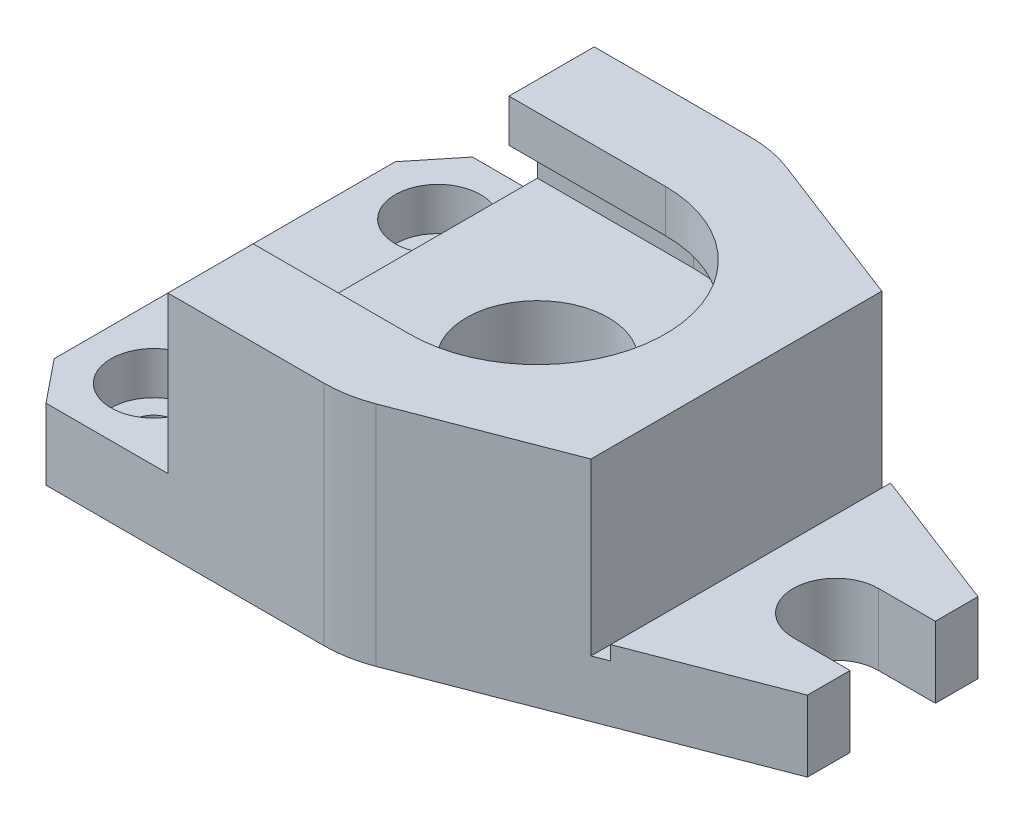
ISO-10303-21;
HEADER;
FILE_DESCRIPTION(('STEP AP214'),'2;1');
FILE_NAME('part.step','',(''),(''),'','','');
FILE_SCHEMA(('AUTOMOTIVE_DESIGN { 1 0 10303 214 1 1 1 1 }'));
ENDSEC;
DATA;
#1=APPLICATION_CONTEXT('core data for automotive mechanical design processes');
#2=APPLICATION_PROTOCOL_DEFINITION('international standard','automotive_design',2000,#1);
#3=PRODUCT_CONTEXT('',#1,'mechanical');
#4=PRODUCT('Part','Part','',(#3));
#5=PRODUCT_RELATED_PRODUCT_CATEGORY('part','',(#4));
#6=PRODUCT_DEFINITION_FORMATION('','',#4);
#7=PRODUCT_DEFINITION_CONTEXT('part definition',#1,'design');
#8=PRODUCT_DEFINITION('design','',#6,#7);
#9=PRODUCT_DEFINITION_SHAPE('','',#8);
#10=(LENGTH_UNIT() NAMED_UNIT(*) SI_UNIT(.MILLI.,.METRE.));
#11=(NAMED_UNIT(*) PLANE_ANGLE_UNIT() SI_UNIT($,.RADIAN.));
#12=(NAMED_UNIT(*) SI_UNIT($,.STERADIAN.) SOLID_ANGLE_UNIT());
#13=UNCERTAINTY_MEASURE_WITH_UNIT(LENGTH_MEASURE(1.E-05),#10,'distance_accuracy_value','');
#14=(GEOMETRIC_REPRESENTATION_CONTEXT(3) GLOBAL_UNCERTAINTY_ASSIGNED_CONTEXT((#13)) GLOBAL_UNIT_ASSIGNED_CONTEXT((#10,
#11,#12)) REPRESENTATION_CONTEXT('',''));
#15=CARTESIAN_POINT('',(0.,0.,0.));
#16=DIRECTION('',(0.,0.,1.));
#17=DIRECTION('',(1.,0.,0.));
#18=AXIS2_PLACEMENT_3D('',#15,#16,#17);
#19=CARTESIAN_POINT('',(-17.,0.,-10.));
#20=DIRECTION('',(0.,1.,0.));
#21=DIRECTION('',(0.,0.,1.));
#22=AXIS2_PLACEMENT_3D('',#19,#20,#21);
#23=CYLINDRICAL_SURFACE('',#22,1.5);
#24=CARTESIAN_POINT('',(-17.,0.,-10.));
#25=DIRECTION('',(0.,1.,0.));
#26=DIRECTION('',(0.,0.,1.));
#27=AXIS2_PLACEMENT_3D('',#24,#25,#26);
#28=CIRCLE('',#27,1.5);
#29=CARTESIAN_POINT('',(-17.,0.,-8.5));
#30=VERTEX_POINT('',#29);
#31=EDGE_CURVE('E270',#30,#30,#28,.T.);
#32=ORIENTED_EDGE('',*,*,#31,.F.);
#33=EDGE_LOOP('',(#32));
#34=FACE_BOUND('',#33,.T.);
#35=CARTESIAN_POINT('',(-17.,2.,-10.));
#36=DIRECTION('',(0.,1.,0.));
#37=DIRECTION('',(0.,0.,1.));
#38=AXIS2_PLACEMENT_3D('',#35,#36,#37);
#39=CIRCLE('',#38,1.5);
#40=CARTESIAN_POINT('',(-17.,2.,-8.5));
#41=VERTEX_POINT('',#40);
#42=EDGE_CURVE('E263',#41,#41,#39,.F.);
#43=ORIENTED_EDGE('',*,*,#42,.F.);
#44=EDGE_LOOP('',(#43));
#45=FACE_BOUND('',#44,.T.);
#46=ADVANCED_FACE('F31',(#34,#45),#23,.F.);
#47=CARTESIAN_POINT('',(0.,5.,-6.39968337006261));
#48=DIRECTION('',(0.,-1.,0.));
#49=DIRECTION('',(0.,0.,-1.));
#50=AXIS2_PLACEMENT_3D('',#47,#48,#49);
#51=PLANE('',#50);
#52=DIRECTION('',(-0.93336269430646,0.,-0.358934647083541));
#53=VECTOR('',#52,1.);
#54=CARTESIAN_POINT('',(25.,5.,-6.));
#55=LINE('',#54,#53);
#56=CARTESIAN_POINT('',(25.,5.,-6.));
#57=VERTEX_POINT('',#56);
#58=CARTESIAN_POINT('',(15.,5.,-9.84560738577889));
#59=VERTEX_POINT('',#58);
#60=EDGE_CURVE('E565',#57,#59,#55,.T.);
#61=ORIENTED_EDGE('',*,*,#60,.T.);
#62=DIRECTION('',(0.,0.,-1.));
#63=VECTOR('',#62,1.);
#64=CARTESIAN_POINT('',(15.,5.,9.84560738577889));
#65=LINE('',#64,#63);
#66=CARTESIAN_POINT('',(15.,5.,9.84560738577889));
#67=VERTEX_POINT('',#66);
#68=EDGE_CURVE('E243',#67,#59,#65,.T.);
#69=ORIENTED_EDGE('',*,*,#68,.F.);
#70=DIRECTION('',(0.93336269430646,0.,-0.358934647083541));
#71=VECTOR('',#70,1.);
#72=CARTESIAN_POINT('',(25.,5.,6.));
#73=LINE('',#72,#71);
#74=CARTESIAN_POINT('',(25.,5.,6.));
#75=VERTEX_POINT('',#74);
#76=EDGE_CURVE('E35',#67,#75,#73,.T.);
#77=ORIENTED_EDGE('',*,*,#76,.T.);
#78=DIRECTION('',(0.,0.,-1.));
#79=VECTOR('',#78,1.);
#80=CARTESIAN_POINT('',(25.,5.,3.));
#81=LINE('',#80,#79);
#82=CARTESIAN_POINT('',(25.,5.,3.));
#83=VERTEX_POINT('',#82);
#84=EDGE_CURVE('E573',#75,#83,#81,.T.);
#85=ORIENTED_EDGE('',*,*,#84,.T.);
#86=DIRECTION('',(-1.,0.,0.));
#87=VECTOR('',#86,1.);
#88=CARTESIAN_POINT('',(21.,5.,3.));
#89=LINE('',#88,#87);
#90=CARTESIAN_POINT('',(21.,5.,3.));
#91=VERTEX_POINT('',#90);
#92=EDGE_CURVE('E575',#83,#91,#89,.T.);
#93=ORIENTED_EDGE('',*,*,#92,.T.);
#94=CARTESIAN_POINT('',(21.,5.,0.));
#95=DIRECTION('',(0.,-1.,0.));
#96=DIRECTION('',(0.,0.,1.));
#97=AXIS2_PLACEMENT_3D('',#94,#95,#96);
#98=CIRCLE('',#97,3.);
#99=CARTESIAN_POINT('',(21.,5.,-3.));
#100=VERTEX_POINT('',#99);
#101=EDGE_CURVE('E577',#91,#100,#98,.T.);
#102=ORIENTED_EDGE('',*,*,#101,.T.);
#103=DIRECTION('',(1.,0.,0.));
#104=VECTOR('',#103,1.);
#105=CARTESIAN_POINT('',(21.,5.,-3.));
#106=LINE('',#105,#104);
#107=CARTESIAN_POINT('',(25.,5.,-3.));
#108=VERTEX_POINT('',#107);
#109=EDGE_CURVE('E579',#100,#108,#106,.T.);
#110=ORIENTED_EDGE('',*,*,#109,.T.);
#111=DIRECTION('',(0.,0.,-1.));
#112=VECTOR('',#111,1.);
#113=CARTESIAN_POINT('',(25.,5.,-3.));
#114=LINE('',#113,#112);
#115=EDGE_CURVE('E581',#108,#57,#114,.T.);
#116=ORIENTED_EDGE('',*,*,#115,.T.);
#117=EDGE_LOOP('',(#61,#69,#77,#85,#93,#102,#110,#116));
#118=FACE_BOUND('',#117,.T.);
#119=ADVANCED_FACE('F367',(#118),#51,.F.);
#120=CARTESIAN_POINT('',(-17.,5.,10.));
#121=DIRECTION('',(0.,1.,0.));
#122=DIRECTION('',(0.,0.,-1.));
#123=AXIS2_PLACEMENT_3D('',#120,#121,#122);
#124=CIRCLE('',#123,3.);
#125=CARTESIAN_POINT('',(-17.,5.,7.));
#126=VERTEX_POINT('',#125);
#127=EDGE_CURVE('E252',#126,#126,#124,.T.);
#128=ORIENTED_EDGE('',*,*,#127,.F.);
#129=EDGE_LOOP('',(#128));
#130=FACE_BOUND('',#129,.T.);
#131=CARTESIAN_POINT('',(-17.,5.,-10.));
#132=DIRECTION('',(0.,1.,0.));
#133=DIRECTION('',(0.,0.,1.));
#134=AXIS2_PLACEMENT_3D('',#131,#132,#133);
#135=CIRCLE('',#134,3.);
#136=CARTESIAN_POINT('',(-17.,5.,-7.));
#137=VERTEX_POINT('',#136);
#138=EDGE_CURVE('E264',#137,#137,#135,.T.);
#139=ORIENTED_EDGE('',*,*,#138,.F.);
#140=EDGE_LOOP('',(#139));
#141=FACE_BOUND('',#140,.T.);
#142=DIRECTION('',(0.,0.,1.));
#143=VECTOR('',#142,1.);
#144=CARTESIAN_POINT('',(-11.,5.,11.));
#145=LINE('',#144,#143);
#146=CARTESIAN_POINT('',(-11.,5.,-15.));
#147=VERTEX_POINT('',#146);
#148=CARTESIAN_POINT('',(-11.,5.,15.));
#149=VERTEX_POINT('',#148);
#150=EDGE_CURVE('E586',#147,#149,#145,.T.);
#151=ORIENTED_EDGE('',*,*,#150,.F.);
#152=DIRECTION('',(-1.,0.,0.));
#153=VECTOR('',#152,1.);
#154=CARTESIAN_POINT('',(-19.5748211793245,5.,-15.));
#155=LINE('',#154,#153);
#156=CARTESIAN_POINT('',(-19.5748211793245,5.,-15.));
#157=VERTEX_POINT('',#156);
#158=EDGE_CURVE('E531',#147,#157,#155,.T.);
#159=ORIENTED_EDGE('',*,*,#158,.T.);
#160=DIRECTION('',(-0.628666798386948,0.,0.777674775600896));
#161=VECTOR('',#160,1.);
#162=CARTESIAN_POINT('',(-22.,5.,-12.));
#163=LINE('',#162,#161);
#164=CARTESIAN_POINT('',(-22.,5.,-12.));
#165=VERTEX_POINT('',#164);
#166=EDGE_CURVE('E526',#157,#165,#163,.T.);
#167=ORIENTED_EDGE('',*,*,#166,.T.);
#168=DIRECTION('',(0.,0.,1.));
#169=VECTOR('',#168,1.);
#170=CARTESIAN_POINT('',(-22.,5.,12.));
#171=LINE('',#170,#169);
#172=CARTESIAN_POINT('',(-22.,5.,12.));
#173=VERTEX_POINT('',#172);
#174=EDGE_CURVE('E599',#165,#173,#171,.T.);
#175=ORIENTED_EDGE('',*,*,#174,.T.);
#176=DIRECTION('',(0.628666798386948,0.,0.777674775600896));
#177=VECTOR('',#176,1.);
#178=CARTESIAN_POINT('',(-22.,5.,12.));
#179=LINE('',#178,#177);
#180=CARTESIAN_POINT('',(-19.5748211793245,5.,15.));
#181=VERTEX_POINT('',#180);
#182=EDGE_CURVE('E496',#173,#181,#179,.T.);
#183=ORIENTED_EDGE('',*,*,#182,.T.);
#184=DIRECTION('',(1.,0.,0.));
#185=VECTOR('',#184,1.);
#186=CARTESIAN_POINT('',(-19.5748211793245,5.,15.));
#187=LINE('',#186,#185);
#188=EDGE_CURVE('E562',#181,#149,#187,.T.);
#189=ORIENTED_EDGE('',*,*,#188,.T.);
#190=EDGE_LOOP('',(#151,#159,#167,#175,#183,#189));
#191=FACE_BOUND('',#190,.T.);
#192=ADVANCED_FACE('F373',(#130,#141,#191),#51,.F.);
#193=CARTESIAN_POINT('',(-22.,5.,-12.));
#194=DIRECTION('',(0.777674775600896,0.,0.628666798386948));
#195=DIRECTION('',(0.628666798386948,0.,-0.777674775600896));
#196=AXIS2_PLACEMENT_3D('',#193,#194,#195);
#197=PLANE('',#196);
#198=DIRECTION('',(-0.628666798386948,0.,0.777674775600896));
#199=VECTOR('',#198,1.);
#200=CARTESIAN_POINT('',(-22.,0.,-12.));
#201=LINE('',#200,#199);
#202=CARTESIAN_POINT('',(-19.5748211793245,0.,-15.));
#203=VERTEX_POINT('',#202);
#204=CARTESIAN_POINT('',(-22.,0.,-12.));
#205=VERTEX_POINT('',#204);
#206=EDGE_CURVE('E492',#203,#205,#201,.T.);
#207=ORIENTED_EDGE('',*,*,#206,.T.);
#208=DIRECTION('',(0.,-1.,0.));
#209=VECTOR('',#208,1.);
#210=CARTESIAN_POINT('',(-22.,5.,-12.));
#211=LINE('',#210,#209);
#212=EDGE_CURVE('E11',#165,#205,#211,.T.);
#213=ORIENTED_EDGE('',*,*,#212,.F.);
#214=ORIENTED_EDGE('',*,*,#166,.F.);
#215=DIRECTION('',(0.,-1.,0.));
#216=VECTOR('',#215,1.);
#217=CARTESIAN_POINT('',(-19.5748211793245,5.,-15.));
#218=LINE('',#217,#216);
#219=EDGE_CURVE('E527',#157,#203,#218,.T.);
#220=ORIENTED_EDGE('',*,*,#219,.T.);
#221=EDGE_LOOP('',(#207,#213,#214,#220));
#222=FACE_BOUND('',#221,.T.);
#223=ADVANCED_FACE('F33',(#222),#197,.F.);
#224=CARTESIAN_POINT('',(-22.,5.,12.));
#225=DIRECTION('',(1.,0.,0.));
#226=DIRECTION('',(0.,0.,-1.));
#227=AXIS2_PLACEMENT_3D('',#224,#225,#226);
#228=PLANE('',#227);
#229=DIRECTION('',(0.,0.,1.));
#230=VECTOR('',#229,1.);
#231=CARTESIAN_POINT('',(-22.,0.,12.));
#232=LINE('',#231,#230);
#233=CARTESIAN_POINT('',(-22.,0.,12.));
#234=VERTEX_POINT('',#233);
#235=EDGE_CURVE('E483',#205,#234,#232,.T.);
#236=ORIENTED_EDGE('',*,*,#235,.T.);
#237=DIRECTION('',(0.,-1.,0.));
#238=VECTOR('',#237,1.);
#239=CARTESIAN_POINT('',(-22.,5.,12.));
#240=LINE('',#239,#238);
#241=EDGE_CURVE('E41',#173,#234,#240,.T.);
#242=ORIENTED_EDGE('',*,*,#241,.F.);
#243=ORIENTED_EDGE('',*,*,#174,.F.);
#244=ORIENTED_EDGE('',*,*,#212,.T.);
#245=EDGE_LOOP('',(#236,#242,#243,#244));
#246=FACE_BOUND('',#245,.T.);
#247=ADVANCED_FACE('F474',(#246),#228,.F.);
#248=CARTESIAN_POINT('',(-22.,5.,12.));
#249=DIRECTION('',(0.777674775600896,0.,-0.628666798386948));
#250=DIRECTION('',(-0.628666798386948,0.,-0.777674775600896));
#251=AXIS2_PLACEMENT_3D('',#248,#249,#250);
#252=PLANE('',#251);
#253=DIRECTION('',(0.628666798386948,0.,0.777674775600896));
#254=VECTOR('',#253,1.);
#255=CARTESIAN_POINT('',(-22.,0.,12.));
#256=LINE('',#255,#254);
#257=CARTESIAN_POINT('',(-19.5748211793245,0.,15.));
#258=VERTEX_POINT('',#257);
#259=EDGE_CURVE('E491',#234,#258,#256,.T.);
#260=ORIENTED_EDGE('',*,*,#259,.T.);
#261=DIRECTION('',(0.,-1.,0.));
#262=VECTOR('',#261,1.);
#263=CARTESIAN_POINT('',(-19.5748211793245,5.,15.));
#264=LINE('',#263,#262);
#265=EDGE_CURVE('E497',#181,#258,#264,.T.);
#266=ORIENTED_EDGE('',*,*,#265,.F.);
#267=ORIENTED_EDGE('',*,*,#182,.F.);
#268=ORIENTED_EDGE('',*,*,#241,.T.);
#269=EDGE_LOOP('',(#260,#266,#267,#268));
#270=FACE_BOUND('',#269,.T.);
#271=ADVANCED_FACE('F471',(#270),#252,.F.);
#272=CARTESIAN_POINT('',(-19.5748211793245,5.,15.));
#273=DIRECTION('',(0.,0.,-1.));
#274=DIRECTION('',(-1.,0.,0.));
#275=AXIS2_PLACEMENT_3D('',#272,#273,#274);
#276=PLANE('',#275);
#277=DIRECTION('',(1.,0.,0.));
#278=VECTOR('',#277,1.);
#279=CARTESIAN_POINT('',(-19.5748211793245,0.,15.));
#280=LINE('',#279,#278);
#281=CARTESIAN_POINT('',(0.,0.,15.));
#282=VERTEX_POINT('',#281);
#283=EDGE_CURVE('E501',#258,#282,#280,.T.);
#284=ORIENTED_EDGE('',*,*,#283,.T.);
#285=DIRECTION('',(0.,-1.,0.));
#286=VECTOR('',#285,1.);
#287=CARTESIAN_POINT('',(0.,5.,15.));
#288=LINE('',#287,#286);
#289=CARTESIAN_POINT('',(0.,16.,15.));
#290=VERTEX_POINT('',#289);
#291=EDGE_CURVE('E558',#290,#282,#288,.T.);
#292=ORIENTED_EDGE('',*,*,#291,.F.);
#293=DIRECTION('',(1.,0.,0.));
#294=VECTOR('',#293,1.);
#295=CARTESIAN_POINT('',(-11.,16.,15.));
#296=LINE('',#295,#294);
#297=CARTESIAN_POINT('',(-11.,16.,15.));
#298=VERTEX_POINT('',#297);
#299=EDGE_CURVE('E289',#298,#290,#296,.T.);
#300=ORIENTED_EDGE('',*,*,#299,.F.);
#301=DIRECTION('',(0.,-1.,0.));
#302=VECTOR('',#301,1.);
#303=CARTESIAN_POINT('',(-11.,10.,15.));
#304=LINE('',#303,#302);
#305=EDGE_CURVE('E591',#298,#149,#304,.T.);
#306=ORIENTED_EDGE('',*,*,#305,.T.);
#307=ORIENTED_EDGE('',*,*,#188,.F.);
#308=ORIENTED_EDGE('',*,*,#265,.T.);
#309=EDGE_LOOP('',(#284,#292,#300,#306,#307,#308));
#310=FACE_BOUND('',#309,.T.);
#311=ADVANCED_FACE('F467',(#310),#276,.F.);
#312=CARTESIAN_POINT('',(0.,5.,6.39968337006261));
#313=DIRECTION('',(0.,-1.,0.));
#314=DIRECTION('',(0.,0.,-1.));
#315=AXIS2_PLACEMENT_3D('',#312,#313,#314);
#316=CYLINDRICAL_SURFACE('',#315,8.60031662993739);
#317=CARTESIAN_POINT('',(0.,0.,6.39968337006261));
#318=DIRECTION('',(0.,1.,0.));
#319=DIRECTION('',(0.,0.,1.));
#320=AXIS2_PLACEMENT_3D('',#317,#318,#319);
#321=CIRCLE('',#320,8.60031662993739);
#322=CARTESIAN_POINT('',(3.08695161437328,0.,14.4268980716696));
#323=VERTEX_POINT('',#322);
#324=EDGE_CURVE('E503',#282,#323,#321,.T.);
#325=ORIENTED_EDGE('',*,*,#324,.T.);
#326=DIRECTION('',(0.,-1.,0.));
#327=VECTOR('',#326,1.);
#328=CARTESIAN_POINT('',(3.08695161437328,5.,14.4268980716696));
#329=LINE('',#328,#327);
#330=CARTESIAN_POINT('',(3.08695161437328,16.,14.4268980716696));
#331=VERTEX_POINT('',#330);
#332=EDGE_CURVE('E555',#331,#323,#329,.T.);
#333=ORIENTED_EDGE('',*,*,#332,.F.);
#334=CARTESIAN_POINT('',(0.,16.,6.39968337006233));
#335=DIRECTION('',(0.,1.,0.));
#336=DIRECTION('',(0.,0.,1.));
#337=AXIS2_PLACEMENT_3D('',#334,#335,#336);
#338=CIRCLE('',#337,8.60031662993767);
#339=EDGE_CURVE('E292',#290,#331,#338,.T.);
#340=ORIENTED_EDGE('',*,*,#339,.F.);
#341=ORIENTED_EDGE('',*,*,#291,.T.);
#342=EDGE_LOOP('',(#325,#333,#340,#341));
#343=FACE_BOUND('',#342,.T.);
#344=ADVANCED_FACE('F463',(#343),#316,.T.);
#345=CARTESIAN_POINT('',(25.,5.,6.));
#346=DIRECTION('',(-0.358934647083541,0.,-0.93336269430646));
#347=DIRECTION('',(-0.93336269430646,0.,0.358934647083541));
#348=AXIS2_PLACEMENT_3D('',#345,#346,#347);
#349=PLANE('',#348);
#350=ORIENTED_EDGE('',*,*,#76,.F.);
#351=DIRECTION('',(0.,1.,0.));
#352=VECTOR('',#351,1.);
#353=CARTESIAN_POINT('',(15.,4.,9.84560738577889));
#354=LINE('',#353,#352);
#355=CARTESIAN_POINT('',(15.,4.,9.84560738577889));
#356=VERTEX_POINT('',#355);
#357=EDGE_CURVE('E248',#356,#67,#354,.T.);
#358=ORIENTED_EDGE('',*,*,#357,.F.);
#359=DIRECTION('',(0.93336269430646,0.,-0.358934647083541));
#360=VECTOR('',#359,1.);
#361=CARTESIAN_POINT('',(14.,4.,10.2301681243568));
#362=LINE('',#361,#360);
#363=CARTESIAN_POINT('',(14.,4.,10.2301681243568));
#364=VERTEX_POINT('',#363);
#365=EDGE_CURVE('E237',#364,#356,#362,.T.);
#366=ORIENTED_EDGE('',*,*,#365,.F.);
#367=DIRECTION('',(0.,-1.,0.));
#368=VECTOR('',#367,1.);
#369=CARTESIAN_POINT('',(14.,10.,10.2301681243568));
#370=LINE('',#369,#368);
#371=CARTESIAN_POINT('',(14.,16.,10.2301681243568));
#372=VERTEX_POINT('',#371);
#373=EDGE_CURVE('E229',#372,#364,#370,.T.);
#374=ORIENTED_EDGE('',*,*,#373,.F.);
#375=DIRECTION('',(0.93336269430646,0.,-0.358934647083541));
#376=VECTOR('',#375,1.);
#377=CARTESIAN_POINT('',(14.,16.,10.2301681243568));
#378=LINE('',#377,#376);
#379=EDGE_CURVE('E295',#331,#372,#378,.T.);
#380=ORIENTED_EDGE('',*,*,#379,.F.);
#381=ORIENTED_EDGE('',*,*,#332,.T.);
#382=DIRECTION('',(0.93336269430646,0.,-0.358934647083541));
#383=VECTOR('',#382,1.);
#384=CARTESIAN_POINT('',(25.,0.,6.));
#385=LINE('',#384,#383);
#386=CARTESIAN_POINT('',(25.,0.,6.));
#387=VERTEX_POINT('',#386);
#388=EDGE_CURVE('E508',#323,#387,#385,.T.);
#389=ORIENTED_EDGE('',*,*,#388,.T.);
#390=DIRECTION('',(0.,-1.,0.));
#391=VECTOR('',#390,1.);
#392=CARTESIAN_POINT('',(25.,5.,6.));
#393=LINE('',#392,#391);
#394=EDGE_CURVE('E552',#75,#387,#393,.T.);
#395=ORIENTED_EDGE('',*,*,#394,.F.);
#396=EDGE_LOOP('',(#350,#358,#366,#374,#380,#381,#389,#395));
#397=FACE_BOUND('',#396,.T.);
#398=ADVANCED_FACE('F459',(#397),#349,.F.);
#399=CARTESIAN_POINT('',(25.,5.,3.));
#400=DIRECTION('',(-1.,0.,0.));
#401=DIRECTION('',(0.,0.,1.));
#402=AXIS2_PLACEMENT_3D('',#399,#400,#401);
#403=PLANE('',#402);
#404=DIRECTION('',(0.,0.,-1.));
#405=VECTOR('',#404,1.);
#406=CARTESIAN_POINT('',(25.,0.,3.));
#407=LINE('',#406,#405);
#408=CARTESIAN_POINT('',(25.,0.,3.));
#409=VERTEX_POINT('',#408);
#410=EDGE_CURVE('E510',#387,#409,#407,.T.);
#411=ORIENTED_EDGE('',*,*,#410,.T.);
#412=DIRECTION('',(0.,-1.,0.));
#413=VECTOR('',#412,1.);
#414=CARTESIAN_POINT('',(25.,5.,3.));
#415=LINE('',#414,#413);
#416=EDGE_CURVE('E549',#83,#409,#415,.T.);
#417=ORIENTED_EDGE('',*,*,#416,.F.);
#418=ORIENTED_EDGE('',*,*,#84,.F.);
#419=ORIENTED_EDGE('',*,*,#394,.T.);
#420=EDGE_LOOP('',(#411,#417,#418,#419));
#421=FACE_BOUND('',#420,.T.);
#422=ADVANCED_FACE('F455',(#421),#403,.F.);
#423=CARTESIAN_POINT('',(21.,5.,3.));
#424=DIRECTION('',(0.,0.,1.));
#425=DIRECTION('',(1.,0.,0.));
#426=AXIS2_PLACEMENT_3D('',#423,#424,#425);
#427=PLANE('',#426);
#428=DIRECTION('',(-1.,0.,0.));
#429=VECTOR('',#428,1.);
#430=CARTESIAN_POINT('',(21.,0.,3.));
#431=LINE('',#430,#429);
#432=CARTESIAN_POINT('',(21.,0.,3.));
#433=VERTEX_POINT('',#432);
#434=EDGE_CURVE('E512',#409,#433,#431,.T.);
#435=ORIENTED_EDGE('',*,*,#434,.T.);
#436=DIRECTION('',(0.,-1.,0.));
#437=VECTOR('',#436,1.);
#438=CARTESIAN_POINT('',(21.,5.,3.));
#439=LINE('',#438,#437);
#440=EDGE_CURVE('E546',#91,#433,#439,.T.);
#441=ORIENTED_EDGE('',*,*,#440,.F.);
#442=ORIENTED_EDGE('',*,*,#92,.F.);
#443=ORIENTED_EDGE('',*,*,#416,.T.);
#444=EDGE_LOOP('',(#435,#441,#442,#443));
#445=FACE_BOUND('',#444,.T.);
#446=ADVANCED_FACE('F451',(#445),#427,.F.);
#447=CARTESIAN_POINT('',(21.,5.,0.));
#448=DIRECTION('',(0.,-1.,0.));
#449=DIRECTION('',(0.,0.,-1.));
#450=AXIS2_PLACEMENT_3D('',#447,#448,#449);
#451=CYLINDRICAL_SURFACE('',#450,3.);
#452=CARTESIAN_POINT('',(21.,0.,0.));
#453=DIRECTION('',(0.,-1.,0.));
#454=DIRECTION('',(0.,0.,1.));
#455=AXIS2_PLACEMENT_3D('',#452,#453,#454);
#456=CIRCLE('',#455,3.);
#457=CARTESIAN_POINT('',(21.,0.,-3.));
#458=VERTEX_POINT('',#457);
#459=EDGE_CURVE('E514',#433,#458,#456,.T.);
#460=ORIENTED_EDGE('',*,*,#459,.T.);
#461=DIRECTION('',(0.,-1.,0.));
#462=VECTOR('',#461,1.);
#463=CARTESIAN_POINT('',(21.,5.,-3.));
#464=LINE('',#463,#462);
#465=EDGE_CURVE('E543',#100,#458,#464,.T.);
#466=ORIENTED_EDGE('',*,*,#465,.F.);
#467=ORIENTED_EDGE('',*,*,#101,.F.);
#468=ORIENTED_EDGE('',*,*,#440,.T.);
#469=EDGE_LOOP('',(#460,#466,#467,#468));
#470=FACE_BOUND('',#469,.T.);
#471=ADVANCED_FACE('F447',(#470),#451,.F.);
#472=CARTESIAN_POINT('',(21.,5.,-3.));
#473=DIRECTION('',(0.,0.,-1.));
#474=DIRECTION('',(-1.,0.,0.));
#475=AXIS2_PLACEMENT_3D('',#472,#473,#474);
#476=PLANE('',#475);
#477=DIRECTION('',(1.,0.,0.));
#478=VECTOR('',#477,1.);
#479=CARTESIAN_POINT('',(21.,0.,-3.));
#480=LINE('',#479,#478);
#481=CARTESIAN_POINT('',(25.,0.,-3.));
#482=VERTEX_POINT('',#481);
#483=EDGE_CURVE('E516',#458,#482,#480,.T.);
#484=ORIENTED_EDGE('',*,*,#483,.T.);
#485=DIRECTION('',(0.,-1.,0.));
#486=VECTOR('',#485,1.);
#487=CARTESIAN_POINT('',(25.,5.,-3.));
#488=LINE('',#487,#486);
#489=EDGE_CURVE('E540',#108,#482,#488,.T.);
#490=ORIENTED_EDGE('',*,*,#489,.F.);
#491=ORIENTED_EDGE('',*,*,#109,.F.);
#492=ORIENTED_EDGE('',*,*,#465,.T.);
#493=EDGE_LOOP('',(#484,#490,#491,#492));
#494=FACE_BOUND('',#493,.T.);
#495=ADVANCED_FACE('F443',(#494),#476,.F.);
#496=CARTESIAN_POINT('',(25.,5.,-3.));
#497=DIRECTION('',(-1.,0.,0.));
#498=DIRECTION('',(0.,0.,1.));
#499=AXIS2_PLACEMENT_3D('',#496,#497,#498);
#500=PLANE('',#499);
#501=DIRECTION('',(0.,0.,-1.));
#502=VECTOR('',#501,1.);
#503=CARTESIAN_POINT('',(25.,0.,-3.));
#504=LINE('',#503,#502);
#505=CARTESIAN_POINT('',(25.,0.,-6.));
#506=VERTEX_POINT('',#505);
#507=EDGE_CURVE('E518',#482,#506,#504,.T.);
#508=ORIENTED_EDGE('',*,*,#507,.T.);
#509=DIRECTION('',(0.,-1.,0.));
#510=VECTOR('',#509,1.);
#511=CARTESIAN_POINT('',(25.,5.,-6.));
#512=LINE('',#511,#510);
#513=EDGE_CURVE('E537',#57,#506,#512,.T.);
#514=ORIENTED_EDGE('',*,*,#513,.F.);
#515=ORIENTED_EDGE('',*,*,#115,.F.);
#516=ORIENTED_EDGE('',*,*,#489,.T.);
#517=EDGE_LOOP('',(#508,#514,#515,#516));
#518=FACE_BOUND('',#517,.T.);
#519=ADVANCED_FACE('F440',(#518),#500,.F.);
#520=CARTESIAN_POINT('',(25.,5.,-6.));
#521=DIRECTION('',(-0.358934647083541,0.,0.93336269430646));
#522=DIRECTION('',(0.93336269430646,0.,0.358934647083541));
#523=AXIS2_PLACEMENT_3D('',#520,#521,#522);
#524=PLANE('',#523);
#525=DIRECTION('',(-0.933362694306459,0.,-0.358934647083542));
#526=VECTOR('',#525,1.);
#527=CARTESIAN_POINT('',(15.,4.,-9.84560738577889));
#528=LINE('',#527,#526);
#529=CARTESIAN_POINT('',(15.,4.,-9.84560738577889));
#530=VERTEX_POINT('',#529);
#531=CARTESIAN_POINT('',(14.,4.,-10.2301681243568));
#532=VERTEX_POINT('',#531);
#533=EDGE_CURVE('E223',#530,#532,#528,.T.);
#534=ORIENTED_EDGE('',*,*,#533,.F.);
#535=DIRECTION('',(0.,1.,0.));
#536=VECTOR('',#535,1.);
#537=CARTESIAN_POINT('',(15.,4.,-9.84560738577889));
#538=LINE('',#537,#536);
#539=EDGE_CURVE('E250',#530,#59,#538,.T.);
#540=ORIENTED_EDGE('',*,*,#539,.T.);
#541=ORIENTED_EDGE('',*,*,#60,.F.);
#542=ORIENTED_EDGE('',*,*,#513,.T.);
#543=DIRECTION('',(-0.93336269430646,0.,-0.358934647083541));
#544=VECTOR('',#543,1.);
#545=CARTESIAN_POINT('',(25.,0.,-6.));
#546=LINE('',#545,#544);
#547=CARTESIAN_POINT('',(3.08695161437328,0.,-14.4268980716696));
#548=VERTEX_POINT('',#547);
#549=EDGE_CURVE('E520',#506,#548,#546,.T.);
#550=ORIENTED_EDGE('',*,*,#549,.T.);
#551=DIRECTION('',(0.,-1.,0.));
#552=VECTOR('',#551,1.);
#553=CARTESIAN_POINT('',(3.08695161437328,5.,-14.4268980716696));
#554=LINE('',#553,#552);
#555=CARTESIAN_POINT('',(3.08695161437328,16.,-14.4268980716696));
#556=VERTEX_POINT('',#555);
#557=EDGE_CURVE('E534',#556,#548,#554,.T.);
#558=ORIENTED_EDGE('',*,*,#557,.F.);
#559=DIRECTION('',(-0.93336269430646,0.,-0.358934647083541));
#560=VECTOR('',#559,1.);
#561=CARTESIAN_POINT('',(3.08695161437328,16.,-14.4268980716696));
#562=LINE('',#561,#560);
#563=CARTESIAN_POINT('',(14.,16.,-10.2301681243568));
#564=VERTEX_POINT('',#563);
#565=EDGE_CURVE('E225',#564,#556,#562,.T.);
#566=ORIENTED_EDGE('',*,*,#565,.F.);
#567=DIRECTION('',(0.,-1.,0.));
#568=VECTOR('',#567,1.);
#569=CARTESIAN_POINT('',(14.,10.,-10.2301681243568));
#570=LINE('',#569,#568);
#571=EDGE_CURVE('E218',#564,#532,#570,.T.);
#572=ORIENTED_EDGE('',*,*,#571,.T.);
#573=EDGE_LOOP('',(#534,#540,#541,#542,#550,#558,#566,#572));
#574=FACE_BOUND('',#573,.T.);
#575=ADVANCED_FACE('F220',(#574),#524,.F.);
#576=CARTESIAN_POINT('',(0.,5.,-6.39968337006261));
#577=DIRECTION('',(0.,-1.,0.));
#578=DIRECTION('',(0.,0.,-1.));
#579=AXIS2_PLACEMENT_3D('',#576,#577,#578);
#580=CYLINDRICAL_SURFACE('',#579,8.60031662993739);
#581=CARTESIAN_POINT('',(0.,0.,-6.39968337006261));
#582=DIRECTION('',(0.,1.,0.));
#583=DIRECTION('',(0.,0.,-1.));
#584=AXIS2_PLACEMENT_3D('',#581,#582,#583);
#585=CIRCLE('',#584,8.60031662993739);
#586=CARTESIAN_POINT('',(0.,0.,-15.));
#587=VERTEX_POINT('',#586);
#588=EDGE_CURVE('E522',#548,#587,#585,.T.);
#589=ORIENTED_EDGE('',*,*,#588,.T.);
#590=DIRECTION('',(0.,-1.,0.));
#591=VECTOR('',#590,1.);
#592=CARTESIAN_POINT('',(0.,5.,-15.));
#593=LINE('',#592,#591);
#594=CARTESIAN_POINT('',(0.,16.,-15.));
#595=VERTEX_POINT('',#594);
#596=EDGE_CURVE('E530',#595,#587,#593,.T.);
#597=ORIENTED_EDGE('',*,*,#596,.F.);
#598=CARTESIAN_POINT('',(0.,16.,-6.39968337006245));
#599=DIRECTION('',(0.,1.,0.));
#600=DIRECTION('',(0.,0.,-1.));
#601=AXIS2_PLACEMENT_3D('',#598,#599,#600);
#602=CIRCLE('',#601,8.60031662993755);
#603=EDGE_CURVE('E301',#556,#595,#602,.T.);
#604=ORIENTED_EDGE('',*,*,#603,.F.);
#605=ORIENTED_EDGE('',*,*,#557,.T.);
#606=EDGE_LOOP('',(#589,#597,#604,#605));
#607=FACE_BOUND('',#606,.T.);
#608=ADVANCED_FACE('F433',(#607),#580,.T.);
#609=CARTESIAN_POINT('',(-19.5748211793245,5.,-15.));
#610=DIRECTION('',(0.,0.,1.));
#611=DIRECTION('',(1.,0.,0.));
#612=AXIS2_PLACEMENT_3D('',#609,#610,#611);
#613=PLANE('',#612);
#614=DIRECTION('',(-1.,0.,0.));
#615=VECTOR('',#614,1.);
#616=CARTESIAN_POINT('',(-19.5748211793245,0.,-15.));
#617=LINE('',#616,#615);
#618=EDGE_CURVE('E524',#587,#203,#617,.T.);
#619=ORIENTED_EDGE('',*,*,#618,.T.);
#620=ORIENTED_EDGE('',*,*,#219,.F.);
#621=ORIENTED_EDGE('',*,*,#158,.F.);
#622=DIRECTION('',(0.,-1.,0.));
#623=VECTOR('',#622,1.);
#624=CARTESIAN_POINT('',(-11.,10.,-15.));
#625=LINE('',#624,#623);
#626=CARTESIAN_POINT('',(-11.,16.,-15.));
#627=VERTEX_POINT('',#626);
#628=EDGE_CURVE('E605',#627,#147,#625,.T.);
#629=ORIENTED_EDGE('',*,*,#628,.F.);
#630=DIRECTION('',(-1.,0.,0.));
#631=VECTOR('',#630,1.);
#632=CARTESIAN_POINT('',(-11.,16.,-15.));
#633=LINE('',#632,#631);
#634=EDGE_CURVE('E304',#595,#627,#633,.T.);
#635=ORIENTED_EDGE('',*,*,#634,.F.);
#636=ORIENTED_EDGE('',*,*,#596,.T.);
#637=EDGE_LOOP('',(#619,#620,#621,#629,#635,#636));
#638=FACE_BOUND('',#637,.T.);
#639=ADVANCED_FACE('F429',(#638),#613,.F.);
#640=CARTESIAN_POINT('',(0.,0.,-6.39968337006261));
#641=DIRECTION('',(0.,-1.,0.));
#642=DIRECTION('',(0.,0.,-1.));
#643=AXIS2_PLACEMENT_3D('',#640,#641,#642);
#644=PLANE('',#643);
#645=CARTESIAN_POINT('',(-17.,0.,10.));
#646=DIRECTION('',(0.,1.,0.));
#647=DIRECTION('',(0.,0.,-1.));
#648=AXIS2_PLACEMENT_3D('',#645,#646,#647);
#649=CIRCLE('',#648,1.49999999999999);
#650=CARTESIAN_POINT('',(-17.,0.,8.5));
#651=VERTEX_POINT('',#650);
#652=EDGE_CURVE('E267',#651,#651,#649,.T.);
#653=ORIENTED_EDGE('',*,*,#652,.T.);
#654=EDGE_LOOP('',(#653));
#655=FACE_BOUND('',#654,.T.);
#656=ORIENTED_EDGE('',*,*,#31,.T.);
#657=EDGE_LOOP('',(#656));
#658=FACE_BOUND('',#657,.T.);
#659=CARTESIAN_POINT('',(0.,0.,0.));
#660=DIRECTION('',(0.,1.,0.));
#661=DIRECTION('',(0.,0.,1.));
#662=AXIS2_PLACEMENT_3D('',#659,#660,#661);
#663=CIRCLE('',#662,5.);
#664=CARTESIAN_POINT('',(0.,0.,5.));
#665=VERTEX_POINT('',#664);
#666=EDGE_CURVE('E274',#665,#665,#663,.T.);
#667=ORIENTED_EDGE('',*,*,#666,.T.);
#668=EDGE_LOOP('',(#667));
#669=FACE_BOUND('',#668,.T.);
#670=ORIENTED_EDGE('',*,*,#206,.F.);
#671=ORIENTED_EDGE('',*,*,#618,.F.);
#672=ORIENTED_EDGE('',*,*,#588,.F.);
#673=ORIENTED_EDGE('',*,*,#549,.F.);
#674=ORIENTED_EDGE('',*,*,#507,.F.);
#675=ORIENTED_EDGE('',*,*,#483,.F.);
#676=ORIENTED_EDGE('',*,*,#459,.F.);
#677=ORIENTED_EDGE('',*,*,#434,.F.);
#678=ORIENTED_EDGE('',*,*,#410,.F.);
#679=ORIENTED_EDGE('',*,*,#388,.F.);
#680=ORIENTED_EDGE('',*,*,#324,.F.);
#681=ORIENTED_EDGE('',*,*,#283,.F.);
#682=ORIENTED_EDGE('',*,*,#259,.F.);
#683=ORIENTED_EDGE('',*,*,#235,.F.);
#684=EDGE_LOOP('',(#670,#671,#672,#673,#674,#675,#676,#677,#678,#679,#680,#681,#682,#683));
#685=FACE_BOUND('',#684,.T.);
#686=ADVANCED_FACE('F424',(#655,#658,#669,#685),#644,.T.);
#687=CARTESIAN_POINT('',(-11.,10.,11.));
#688=DIRECTION('',(1.,0.,0.));
#689=DIRECTION('',(0.,0.,-1.));
#690=AXIS2_PLACEMENT_3D('',#687,#688,#689);
#691=PLANE('',#690);
#692=ORIENTED_EDGE('',*,*,#150,.T.);
#693=ORIENTED_EDGE('',*,*,#305,.F.);
#694=DIRECTION('',(0.,0.,1.));
#695=VECTOR('',#694,1.);
#696=CARTESIAN_POINT('',(-11.,16.,9.));
#697=LINE('',#696,#695);
#698=CARTESIAN_POINT('',(-11.,16.,9.));
#699=VERTEX_POINT('',#698);
#700=EDGE_CURVE('E286',#699,#298,#697,.T.);
#701=ORIENTED_EDGE('',*,*,#700,.F.);
#702=DIRECTION('',(0.,-1.,0.));
#703=VECTOR('',#702,1.);
#704=CARTESIAN_POINT('',(-11.,16.,9.));
#705=LINE('',#704,#703);
#706=CARTESIAN_POINT('',(-11.,13.,9.));
#707=VERTEX_POINT('',#706);
#708=EDGE_CURVE('E640',#699,#707,#705,.T.);
#709=ORIENTED_EDGE('',*,*,#708,.T.);
#710=DIRECTION('',(0.,0.,1.));
#711=VECTOR('',#710,1.);
#712=CARTESIAN_POINT('',(-11.,13.,9.));
#713=LINE('',#712,#711);
#714=CARTESIAN_POINT('',(-11.,13.,11.));
#715=VERTEX_POINT('',#714);
#716=EDGE_CURVE('E316',#707,#715,#713,.T.);
#717=ORIENTED_EDGE('',*,*,#716,.T.);
#718=DIRECTION('',(0.,-1.,0.));
#719=VECTOR('',#718,1.);
#720=CARTESIAN_POINT('',(-11.,13.,11.));
#721=LINE('',#720,#719);
#722=CARTESIAN_POINT('',(-11.,10.,11.));
#723=VERTEX_POINT('',#722);
#724=EDGE_CURVE('E616',#715,#723,#721,.T.);
#725=ORIENTED_EDGE('',*,*,#724,.T.);
#726=DIRECTION('',(0.,0.,1.));
#727=VECTOR('',#726,1.);
#728=CARTESIAN_POINT('',(-11.,10.,-15.));
#729=LINE('',#728,#727);
#730=CARTESIAN_POINT('',(-11.,10.,-11.));
#731=VERTEX_POINT('',#730);
#732=EDGE_CURVE('E230',#731,#723,#729,.T.);
#733=ORIENTED_EDGE('',*,*,#732,.F.);
#734=DIRECTION('',(0.,-1.,0.));
#735=VECTOR('',#734,1.);
#736=CARTESIAN_POINT('',(-11.,13.,-11.));
#737=LINE('',#736,#735);
#738=CARTESIAN_POINT('',(-11.,13.,-11.));
#739=VERTEX_POINT('',#738);
#740=EDGE_CURVE('E622',#739,#731,#737,.T.);
#741=ORIENTED_EDGE('',*,*,#740,.F.);
#742=DIRECTION('',(0.,0.,1.));
#743=VECTOR('',#742,1.);
#744=CARTESIAN_POINT('',(-11.,13.,-9.));
#745=LINE('',#744,#743);
#746=CARTESIAN_POINT('',(-11.,13.,-9.));
#747=VERTEX_POINT('',#746);
#748=EDGE_CURVE('E325',#739,#747,#745,.T.);
#749=ORIENTED_EDGE('',*,*,#748,.T.);
#750=DIRECTION('',(0.,-1.,0.));
#751=VECTOR('',#750,1.);
#752=CARTESIAN_POINT('',(-11.,16.,-9.));
#753=LINE('',#752,#751);
#754=CARTESIAN_POINT('',(-11.,16.,-9.));
#755=VERTEX_POINT('',#754);
#756=EDGE_CURVE('E643',#755,#747,#753,.T.);
#757=ORIENTED_EDGE('',*,*,#756,.F.);
#758=DIRECTION('',(0.,0.,1.));
#759=VECTOR('',#758,1.);
#760=CARTESIAN_POINT('',(-11.,16.,-9.));
#761=LINE('',#760,#759);
#762=EDGE_CURVE('E307',#627,#755,#761,.T.);
#763=ORIENTED_EDGE('',*,*,#762,.F.);
#764=ORIENTED_EDGE('',*,*,#628,.T.);
#765=EDGE_LOOP('',(#692,#693,#701,#709,#717,#725,#733,#741,#749,#757,#763,#764));
#766=FACE_BOUND('',#765,.T.);
#767=ADVANCED_FACE('F422',(#766),#691,.F.);
#768=CARTESIAN_POINT('',(14.,10.,-10.2301681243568));
#769=DIRECTION('',(-1.,0.,0.));
#770=DIRECTION('',(0.,0.,1.));
#771=AXIS2_PLACEMENT_3D('',#768,#769,#770);
#772=PLANE('',#771);
#773=ORIENTED_EDGE('',*,*,#373,.T.);
#774=DIRECTION('',(0.,0.,1.));
#775=VECTOR('',#774,1.);
#776=CARTESIAN_POINT('',(14.,4.,-10.2301681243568));
#777=LINE('',#776,#775);
#778=EDGE_CURVE('E233',#532,#364,#777,.T.);
#779=ORIENTED_EDGE('',*,*,#778,.F.);
#780=ORIENTED_EDGE('',*,*,#571,.F.);
#781=DIRECTION('',(0.,0.,-1.));
#782=VECTOR('',#781,1.);
#783=CARTESIAN_POINT('',(14.,16.,-10.2301681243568));
#784=LINE('',#783,#782);
#785=EDGE_CURVE('E298',#372,#564,#784,.T.);
#786=ORIENTED_EDGE('',*,*,#785,.F.);
#787=EDGE_LOOP('',(#773,#779,#780,#786));
#788=FACE_BOUND('',#787,.T.);
#789=ADVANCED_FACE('F234',(#788),#772,.F.);
#790=CARTESIAN_POINT('',(0.,10.,6.39968337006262));
#791=DIRECTION('',(0.,1.,0.));
#792=DIRECTION('',(0.,0.,1.));
#793=AXIS2_PLACEMENT_3D('',#790,#791,#792);
#794=PLANE('',#793);
#795=CARTESIAN_POINT('',(0.,10.,0.));
#796=DIRECTION('',(0.,1.,0.));
#797=DIRECTION('',(0.,0.,1.));
#798=AXIS2_PLACEMENT_3D('',#795,#796,#797);
#799=CIRCLE('',#798,5.);
#800=CARTESIAN_POINT('',(0.,10.,5.));
#801=VERTEX_POINT('',#800);
#802=EDGE_CURVE('E273',#801,#801,#799,.T.);
#803=ORIENTED_EDGE('',*,*,#802,.F.);
#804=EDGE_LOOP('',(#803));
#805=FACE_BOUND('',#804,.T.);
#806=DIRECTION('',(1.,0.,0.));
#807=VECTOR('',#806,1.);
#808=CARTESIAN_POINT('',(0.,10.,-11.));
#809=LINE('',#808,#807);
#810=CARTESIAN_POINT('',(0.,10.,-11.));
#811=VERTEX_POINT('',#810);
#812=EDGE_CURVE('E331',#731,#811,#809,.T.);
#813=ORIENTED_EDGE('',*,*,#812,.F.);
#814=ORIENTED_EDGE('',*,*,#732,.T.);
#815=DIRECTION('',(-1.,0.,0.));
#816=VECTOR('',#815,1.);
#817=CARTESIAN_POINT('',(0.,10.,11.));
#818=LINE('',#817,#816);
#819=CARTESIAN_POINT('',(0.,10.,11.));
#820=VERTEX_POINT('',#819);
#821=EDGE_CURVE('E54',#820,#723,#818,.T.);
#822=ORIENTED_EDGE('',*,*,#821,.F.);
#823=CARTESIAN_POINT('',(0.,10.,0.));
#824=DIRECTION('',(0.,-1.,0.));
#825=DIRECTION('',(0.,0.,1.));
#826=AXIS2_PLACEMENT_3D('',#823,#824,#825);
#827=CIRCLE('',#826,11.);
#828=EDGE_CURVE('E49',#811,#820,#827,.T.);
#829=ORIENTED_EDGE('',*,*,#828,.F.);
#830=EDGE_LOOP('',(#813,#814,#822,#829));
#831=FACE_BOUND('',#830,.T.);
#832=ADVANCED_FACE('F415',(#805,#831),#794,.T.);
#833=CARTESIAN_POINT('',(0.,13.,0.));
#834=DIRECTION('',(0.,-1.,0.));
#835=DIRECTION('',(0.,0.,-1.));
#836=AXIS2_PLACEMENT_3D('',#833,#834,#835);
#837=CYLINDRICAL_SURFACE('',#836,11.);
#838=ORIENTED_EDGE('',*,*,#828,.T.);
#839=DIRECTION('',(0.,-1.,0.));
#840=VECTOR('',#839,1.);
#841=CARTESIAN_POINT('',(0.,13.,11.));
#842=LINE('',#841,#840);
#843=CARTESIAN_POINT('',(0.,13.,11.));
#844=VERTEX_POINT('',#843);
#845=EDGE_CURVE('E590',#844,#820,#842,.T.);
#846=ORIENTED_EDGE('',*,*,#845,.F.);
#847=CARTESIAN_POINT('',(0.,13.,0.));
#848=DIRECTION('',(0.,-1.,0.));
#849=DIRECTION('',(0.,0.,1.));
#850=AXIS2_PLACEMENT_3D('',#847,#848,#849);
#851=CIRCLE('',#850,11.);
#852=CARTESIAN_POINT('',(0.,13.,-11.));
#853=VERTEX_POINT('',#852);
#854=EDGE_CURVE('E327',#853,#844,#851,.T.);
#855=ORIENTED_EDGE('',*,*,#854,.F.);
#856=DIRECTION('',(0.,-1.,0.));
#857=VECTOR('',#856,1.);
#858=CARTESIAN_POINT('',(0.,13.,-11.));
#859=LINE('',#858,#857);
#860=EDGE_CURVE('E620',#853,#811,#859,.T.);
#861=ORIENTED_EDGE('',*,*,#860,.T.);
#862=EDGE_LOOP('',(#838,#846,#855,#861));
#863=FACE_BOUND('',#862,.T.);
#864=ADVANCED_FACE('F411',(#863),#837,.F.);
#865=CARTESIAN_POINT('',(0.,13.,11.));
#866=DIRECTION('',(0.,0.,1.));
#867=DIRECTION('',(1.,0.,0.));
#868=AXIS2_PLACEMENT_3D('',#865,#866,#867);
#869=PLANE('',#868);
#870=ORIENTED_EDGE('',*,*,#821,.T.);
#871=ORIENTED_EDGE('',*,*,#724,.F.);
#872=DIRECTION('',(-1.,0.,0.));
#873=VECTOR('',#872,1.);
#874=CARTESIAN_POINT('',(0.,13.,11.));
#875=LINE('',#874,#873);
#876=EDGE_CURVE('E330',#844,#715,#875,.T.);
#877=ORIENTED_EDGE('',*,*,#876,.F.);
#878=ORIENTED_EDGE('',*,*,#845,.T.);
#879=EDGE_LOOP('',(#870,#871,#877,#878));
#880=FACE_BOUND('',#879,.T.);
#881=ADVANCED_FACE('F407',(#880),#869,.F.);
#882=CARTESIAN_POINT('',(0.,13.,-11.));
#883=DIRECTION('',(0.,0.,-1.));
#884=DIRECTION('',(-1.,0.,0.));
#885=AXIS2_PLACEMENT_3D('',#882,#883,#884);
#886=PLANE('',#885);
#887=ORIENTED_EDGE('',*,*,#812,.T.);
#888=ORIENTED_EDGE('',*,*,#860,.F.);
#889=DIRECTION('',(1.,0.,0.));
#890=VECTOR('',#889,1.);
#891=CARTESIAN_POINT('',(0.,13.,-11.));
#892=LINE('',#891,#890);
#893=EDGE_CURVE('E339',#739,#853,#892,.T.);
#894=ORIENTED_EDGE('',*,*,#893,.F.);
#895=ORIENTED_EDGE('',*,*,#740,.T.);
#896=EDGE_LOOP('',(#887,#888,#894,#895));
#897=FACE_BOUND('',#896,.T.);
#898=ADVANCED_FACE('F393',(#897),#886,.F.);
#899=CARTESIAN_POINT('',(0.,13.,0.));
#900=DIRECTION('',(0.,1.,0.));
#901=DIRECTION('',(0.,0.,1.));
#902=AXIS2_PLACEMENT_3D('',#899,#900,#901);
#903=PLANE('',#902);
#904=ORIENTED_EDGE('',*,*,#854,.T.);
#905=ORIENTED_EDGE('',*,*,#876,.T.);
#906=ORIENTED_EDGE('',*,*,#716,.F.);
#907=DIRECTION('',(-1.,0.,0.));
#908=VECTOR('',#907,1.);
#909=CARTESIAN_POINT('',(0.,13.,9.));
#910=LINE('',#909,#908);
#911=CARTESIAN_POINT('',(0.,13.,9.));
#912=VERTEX_POINT('',#911);
#913=EDGE_CURVE('E314',#912,#707,#910,.T.);
#914=ORIENTED_EDGE('',*,*,#913,.F.);
#915=CARTESIAN_POINT('',(0.,13.,0.));
#916=DIRECTION('',(0.,-1.,0.));
#917=DIRECTION('',(0.,0.,1.));
#918=AXIS2_PLACEMENT_3D('',#915,#916,#917);
#919=CIRCLE('',#918,9.);
#920=CARTESIAN_POINT('',(0.,13.,-9.));
#921=VERTEX_POINT('',#920);
#922=EDGE_CURVE('E277',#921,#912,#919,.T.);
#923=ORIENTED_EDGE('',*,*,#922,.F.);
#924=DIRECTION('',(1.,0.,0.));
#925=VECTOR('',#924,1.);
#926=CARTESIAN_POINT('',(0.,13.,-9.));
#927=LINE('',#926,#925);
#928=EDGE_CURVE('E284',#747,#921,#927,.T.);
#929=ORIENTED_EDGE('',*,*,#928,.F.);
#930=ORIENTED_EDGE('',*,*,#748,.F.);
#931=ORIENTED_EDGE('',*,*,#893,.T.);
#932=EDGE_LOOP('',(#904,#905,#906,#914,#923,#929,#930,#931));
#933=FACE_BOUND('',#932,.T.);
#934=ADVANCED_FACE('F389',(#933),#903,.F.);
#935=CARTESIAN_POINT('',(0.,16.,0.));
#936=DIRECTION('',(0.,-1.,0.));
#937=DIRECTION('',(0.,0.,-1.));
#938=AXIS2_PLACEMENT_3D('',#935,#936,#937);
#939=CYLINDRICAL_SURFACE('',#938,9.);
#940=ORIENTED_EDGE('',*,*,#922,.T.);
#941=DIRECTION('',(0.,-1.,0.));
#942=VECTOR('',#941,1.);
#943=CARTESIAN_POINT('',(0.,16.,9.));
#944=LINE('',#943,#942);
#945=CARTESIAN_POINT('',(0.,16.,9.));
#946=VERTEX_POINT('',#945);
#947=EDGE_CURVE('E638',#946,#912,#944,.T.);
#948=ORIENTED_EDGE('',*,*,#947,.F.);
#949=CARTESIAN_POINT('',(0.,16.,0.));
#950=DIRECTION('',(0.,-1.,0.));
#951=DIRECTION('',(0.,0.,1.));
#952=AXIS2_PLACEMENT_3D('',#949,#950,#951);
#953=CIRCLE('',#952,9.);
#954=CARTESIAN_POINT('',(0.,16.,-9.));
#955=VERTEX_POINT('',#954);
#956=EDGE_CURVE('E280',#955,#946,#953,.T.);
#957=ORIENTED_EDGE('',*,*,#956,.F.);
#958=DIRECTION('',(0.,-1.,0.));
#959=VECTOR('',#958,1.);
#960=CARTESIAN_POINT('',(0.,16.,-9.));
#961=LINE('',#960,#959);
#962=EDGE_CURVE('E311',#955,#921,#961,.T.);
#963=ORIENTED_EDGE('',*,*,#962,.T.);
#964=EDGE_LOOP('',(#940,#948,#957,#963));
#965=FACE_BOUND('',#964,.T.);
#966=ADVANCED_FACE('F392',(#965),#939,.F.);
#967=CARTESIAN_POINT('',(0.,16.,9.));
#968=DIRECTION('',(0.,0.,1.));
#969=DIRECTION('',(1.,0.,0.));
#970=AXIS2_PLACEMENT_3D('',#967,#968,#969);
#971=PLANE('',#970);
#972=ORIENTED_EDGE('',*,*,#913,.T.);
#973=ORIENTED_EDGE('',*,*,#708,.F.);
#974=DIRECTION('',(-1.,0.,0.));
#975=VECTOR('',#974,1.);
#976=CARTESIAN_POINT('',(0.,16.,9.));
#977=LINE('',#976,#975);
#978=EDGE_CURVE('E283',#946,#699,#977,.T.);
#979=ORIENTED_EDGE('',*,*,#978,.F.);
#980=ORIENTED_EDGE('',*,*,#947,.T.);
#981=EDGE_LOOP('',(#972,#973,#979,#980));
#982=FACE_BOUND('',#981,.T.);
#983=ADVANCED_FACE('F397',(#982),#971,.F.);
#984=CARTESIAN_POINT('',(0.,16.,-9.));
#985=DIRECTION('',(0.,0.,-1.));
#986=DIRECTION('',(-1.,0.,0.));
#987=AXIS2_PLACEMENT_3D('',#984,#985,#986);
#988=PLANE('',#987);
#989=ORIENTED_EDGE('',*,*,#928,.T.);
#990=ORIENTED_EDGE('',*,*,#962,.F.);
#991=DIRECTION('',(1.,0.,0.));
#992=VECTOR('',#991,1.);
#993=CARTESIAN_POINT('',(0.,16.,-9.));
#994=LINE('',#993,#992);
#995=EDGE_CURVE('E309',#755,#955,#994,.T.);
#996=ORIENTED_EDGE('',*,*,#995,.F.);
#997=ORIENTED_EDGE('',*,*,#756,.T.);
#998=EDGE_LOOP('',(#989,#990,#996,#997));
#999=FACE_BOUND('',#998,.T.);
#1000=ADVANCED_FACE('F387',(#999),#988,.F.);
#1001=CARTESIAN_POINT('',(0.,16.,0.));
#1002=DIRECTION('',(0.,1.,0.));
#1003=DIRECTION('',(0.,0.,1.));
#1004=AXIS2_PLACEMENT_3D('',#1001,#1002,#1003);
#1005=PLANE('',#1004);
#1006=ORIENTED_EDGE('',*,*,#956,.T.);
#1007=ORIENTED_EDGE('',*,*,#978,.T.);
#1008=ORIENTED_EDGE('',*,*,#700,.T.);
#1009=ORIENTED_EDGE('',*,*,#299,.T.);
#1010=ORIENTED_EDGE('',*,*,#339,.T.);
#1011=ORIENTED_EDGE('',*,*,#379,.T.);
#1012=ORIENTED_EDGE('',*,*,#785,.T.);
#1013=ORIENTED_EDGE('',*,*,#565,.T.);
#1014=ORIENTED_EDGE('',*,*,#603,.T.);
#1015=ORIENTED_EDGE('',*,*,#634,.T.);
#1016=ORIENTED_EDGE('',*,*,#762,.T.);
#1017=ORIENTED_EDGE('',*,*,#995,.T.);
#1018=EDGE_LOOP('',(#1006,#1007,#1008,#1009,#1010,#1011,#1012,#1013,#1014,#1015,#1016,#1017));
#1019=FACE_BOUND('',#1018,.T.);
#1020=ADVANCED_FACE('F383',(#1019),#1005,.T.);
#1021=CARTESIAN_POINT('',(0.,0.,0.));
#1022=DIRECTION('',(0.,1.,0.));
#1023=DIRECTION('',(0.,0.,1.));
#1024=AXIS2_PLACEMENT_3D('',#1021,#1022,#1023);
#1025=CYLINDRICAL_SURFACE('',#1024,5.);
#1026=ORIENTED_EDGE('',*,*,#666,.F.);
#1027=EDGE_LOOP('',(#1026));
#1028=FACE_BOUND('',#1027,.T.);
#1029=ORIENTED_EDGE('',*,*,#802,.T.);
#1030=EDGE_LOOP('',(#1029));
#1031=FACE_BOUND('',#1030,.T.);
#1032=ADVANCED_FACE('F380',(#1028,#1031),#1025,.F.);
#1033=CARTESIAN_POINT('',(-17.,0.,10.));
#1034=DIRECTION('',(0.,1.,0.));
#1035=DIRECTION('',(0.,0.,1.));
#1036=AXIS2_PLACEMENT_3D('',#1033,#1034,#1035);
#1037=CYLINDRICAL_SURFACE('',#1036,1.49999999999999);
#1038=CARTESIAN_POINT('',(-17.,2.,10.));
#1039=DIRECTION('',(0.,-1.,0.));
#1040=DIRECTION('',(0.,0.,-1.));
#1041=AXIS2_PLACEMENT_3D('',#1038,#1039,#1040);
#1042=CIRCLE('',#1041,1.49999999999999);
#1043=CARTESIAN_POINT('',(-17.,2.,8.5));
#1044=VERTEX_POINT('',#1043);
#1045=EDGE_CURVE('E257',#1044,#1044,#1042,.F.);
#1046=ORIENTED_EDGE('',*,*,#1045,.T.);
#1047=EDGE_LOOP('',(#1046));
#1048=FACE_BOUND('',#1047,.T.);
#1049=ORIENTED_EDGE('',*,*,#652,.F.);
#1050=EDGE_LOOP('',(#1049));
#1051=FACE_BOUND('',#1050,.T.);
#1052=ADVANCED_FACE('F346',(#1048,#1051),#1037,.F.);
#1053=CARTESIAN_POINT('',(-17.,2.,-10.));
#1054=DIRECTION('',(0.,1.,0.));
#1055=DIRECTION('',(0.,0.,1.));
#1056=AXIS2_PLACEMENT_3D('',#1053,#1054,#1055);
#1057=PLANE('',#1056);
#1058=CARTESIAN_POINT('',(-17.,2.,-10.));
#1059=DIRECTION('',(0.,1.,0.));
#1060=DIRECTION('',(0.,0.,1.));
#1061=AXIS2_PLACEMENT_3D('',#1058,#1059,#1060);
#1062=CIRCLE('',#1061,3.);
#1063=CARTESIAN_POINT('',(-17.,2.,-7.));
#1064=VERTEX_POINT('',#1063);
#1065=EDGE_CURVE('E260',#1064,#1064,#1062,.T.);
#1066=ORIENTED_EDGE('',*,*,#1065,.T.);
#1067=EDGE_LOOP('',(#1066));
#1068=FACE_BOUND('',#1067,.T.);
#1069=ORIENTED_EDGE('',*,*,#42,.T.);
#1070=EDGE_LOOP('',(#1069));
#1071=FACE_BOUND('',#1070,.T.);
#1072=ADVANCED_FACE('F362',(#1068,#1071),#1057,.T.);
#1073=CARTESIAN_POINT('',(-17.,2.,-10.));
#1074=DIRECTION('',(0.,1.,0.));
#1075=DIRECTION('',(0.,0.,1.));
#1076=AXIS2_PLACEMENT_3D('',#1073,#1074,#1075);
#1077=CYLINDRICAL_SURFACE('',#1076,3.);
#1078=ORIENTED_EDGE('',*,*,#1065,.F.);
#1079=EDGE_LOOP('',(#1078));
#1080=FACE_BOUND('',#1079,.T.);
#1081=ORIENTED_EDGE('',*,*,#138,.T.);
#1082=EDGE_LOOP('',(#1081));
#1083=FACE_BOUND('',#1082,.T.);
#1084=ADVANCED_FACE('F352',(#1080,#1083),#1077,.F.);
#1085=CARTESIAN_POINT('',(-17.,2.,10.));
#1086=DIRECTION('',(0.,-1.,0.));
#1087=DIRECTION('',(0.,0.,-1.));
#1088=AXIS2_PLACEMENT_3D('',#1085,#1086,#1087);
#1089=PLANE('',#1088);
#1090=CARTESIAN_POINT('',(-17.,2.,10.));
#1091=DIRECTION('',(0.,1.,0.));
#1092=DIRECTION('',(0.,0.,-1.));
#1093=AXIS2_PLACEMENT_3D('',#1090,#1091,#1092);
#1094=CIRCLE('',#1093,3.);
#1095=CARTESIAN_POINT('',(-17.,2.,7.));
#1096=VERTEX_POINT('',#1095);
#1097=EDGE_CURVE('E254',#1096,#1096,#1094,.T.);
#1098=ORIENTED_EDGE('',*,*,#1097,.T.);
#1099=EDGE_LOOP('',(#1098));
#1100=FACE_BOUND('',#1099,.T.);
#1101=ORIENTED_EDGE('',*,*,#1045,.F.);
#1102=EDGE_LOOP('',(#1101));
#1103=FACE_BOUND('',#1102,.T.);
#1104=ADVANCED_FACE('F349',(#1100,#1103),#1089,.F.);
#1105=CARTESIAN_POINT('',(-17.,2.,10.));
#1106=DIRECTION('',(0.,1.,0.));
#1107=DIRECTION('',(0.,0.,1.));
#1108=AXIS2_PLACEMENT_3D('',#1105,#1106,#1107);
#1109=CYLINDRICAL_SURFACE('',#1108,3.);
#1110=ORIENTED_EDGE('',*,*,#1097,.F.);
#1111=EDGE_LOOP('',(#1110));
#1112=FACE_BOUND('',#1111,.T.);
#1113=ORIENTED_EDGE('',*,*,#127,.T.);
#1114=EDGE_LOOP('',(#1113));
#1115=FACE_BOUND('',#1114,.T.);
#1116=ADVANCED_FACE('F351',(#1112,#1115),#1109,.F.);
#1117=CARTESIAN_POINT('',(15.,4.,9.84560738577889));
#1118=DIRECTION('',(1.,0.,0.));
#1119=DIRECTION('',(0.,0.,-1.));
#1120=AXIS2_PLACEMENT_3D('',#1117,#1118,#1119);
#1121=PLANE('',#1120);
#1122=ORIENTED_EDGE('',*,*,#68,.T.);
#1123=ORIENTED_EDGE('',*,*,#539,.F.);
#1124=DIRECTION('',(0.,0.,-1.));
#1125=VECTOR('',#1124,1.);
#1126=CARTESIAN_POINT('',(15.,4.,9.84560738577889));
#1127=LINE('',#1126,#1125);
#1128=EDGE_CURVE('E242',#356,#530,#1127,.T.);
#1129=ORIENTED_EDGE('',*,*,#1128,.F.);
#1130=ORIENTED_EDGE('',*,*,#357,.T.);
#1131=EDGE_LOOP('',(#1122,#1123,#1129,#1130));
#1132=FACE_BOUND('',#1131,.T.);
#1133=ADVANCED_FACE('F359',(#1132),#1121,.F.);
#1134=CARTESIAN_POINT('',(15.,4.,-9.84560738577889));
#1135=DIRECTION('',(0.,-1.,0.));
#1136=DIRECTION('',(0.,0.,-1.));
#1137=AXIS2_PLACEMENT_3D('',#1134,#1135,#1136);
#1138=PLANE('',#1137);
#1139=ORIENTED_EDGE('',*,*,#533,.T.);
#1140=ORIENTED_EDGE('',*,*,#778,.T.);
#1141=ORIENTED_EDGE('',*,*,#365,.T.);
#1142=ORIENTED_EDGE('',*,*,#1128,.T.);
#1143=EDGE_LOOP('',(#1139,#1140,#1141,#1142));
#1144=FACE_BOUND('',#1143,.T.);
#1145=ADVANCED_FACE('F240',(#1144),#1138,.F.);
#1146=CLOSED_SHELL('',(#46,#119,#192,#223,#247,#271,#311,#344,#398,#422,#446,#471,#495,#519,
#575,#608,#639,#686,#767,#789,#832,#864,#881,#898,#934,#966,#983,#1000,#1020,#1032,#1052,#1072,
#1084,#1104,#1116,#1133,#1145));
#1147=MANIFOLD_SOLID_BREP('B2',#1146);
#1148=ADVANCED_BREP_SHAPE_REPRESENTATION('',(#18,#1147),#14);
#1149=SHAPE_DEFINITION_REPRESENTATION(#9,#1148);
ENDSEC;
END-ISO-10303-21;
